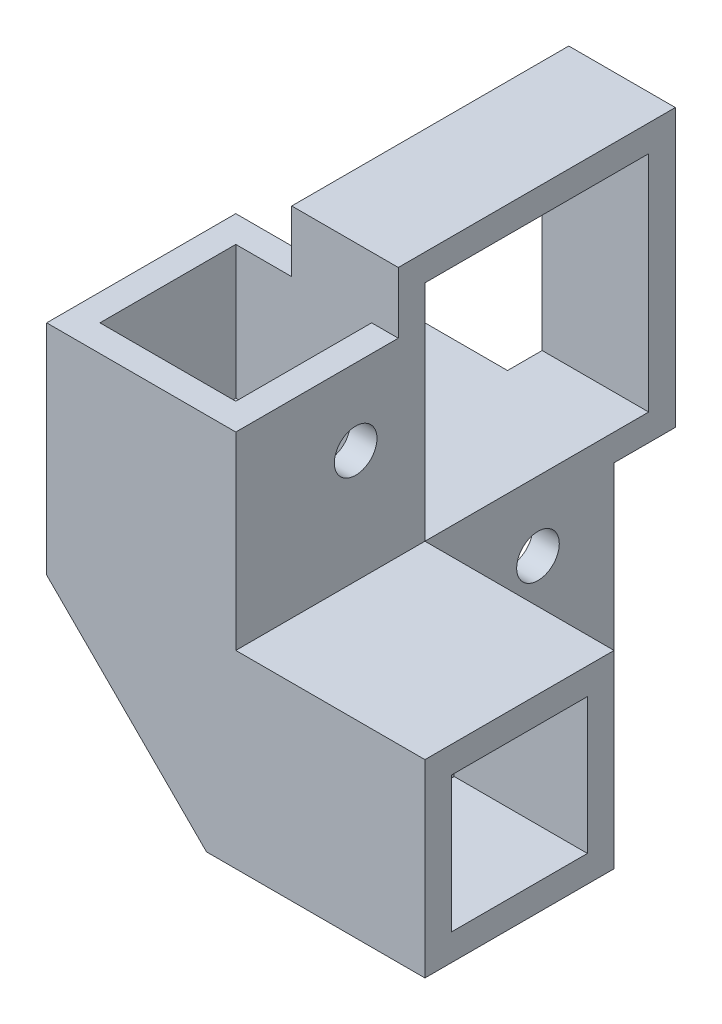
ISO-10303-21;
HEADER;
FILE_DESCRIPTION(('STEP AP214'),'2;1');
FILE_NAME('part.step','',(''),(''),'','','');
FILE_SCHEMA(('AUTOMOTIVE_DESIGN { 1 0 10303 214 1 1 1 1 }'));
ENDSEC;
DATA;
#1=APPLICATION_CONTEXT('core data for automotive mechanical design processes');
#2=APPLICATION_PROTOCOL_DEFINITION('international standard','automotive_design',2000,#1);
#3=PRODUCT_CONTEXT('',#1,'mechanical');
#4=PRODUCT('Part','Part','',(#3));
#5=PRODUCT_RELATED_PRODUCT_CATEGORY('part','',(#4));
#6=PRODUCT_DEFINITION_FORMATION('','',#4);
#7=PRODUCT_DEFINITION_CONTEXT('part definition',#1,'design');
#8=PRODUCT_DEFINITION('design','',#6,#7);
#9=PRODUCT_DEFINITION_SHAPE('','',#8);
#10=(LENGTH_UNIT() NAMED_UNIT(*) SI_UNIT(.MILLI.,.METRE.));
#11=(NAMED_UNIT(*) PLANE_ANGLE_UNIT() SI_UNIT($,.RADIAN.));
#12=(NAMED_UNIT(*) SI_UNIT($,.STERADIAN.) SOLID_ANGLE_UNIT());
#13=UNCERTAINTY_MEASURE_WITH_UNIT(LENGTH_MEASURE(1.E-05),#10,'distance_accuracy_value','');
#14=(GEOMETRIC_REPRESENTATION_CONTEXT(3) GLOBAL_UNCERTAINTY_ASSIGNED_CONTEXT((#13)) GLOBAL_UNIT_ASSIGNED_CONTEXT((#10,
#11,#12)) REPRESENTATION_CONTEXT('',''));
#15=CARTESIAN_POINT('',(0.,0.,0.));
#16=DIRECTION('',(0.,0.,1.));
#17=DIRECTION('',(1.,0.,0.));
#18=AXIS2_PLACEMENT_3D('',#15,#16,#17);
#19=CARTESIAN_POINT('',(0.,0.,0.));
#20=DIRECTION('',(0.,-1.,0.));
#21=DIRECTION('',(0.,0.,-1.));
#22=AXIS2_PLACEMENT_3D('',#19,#20,#21);
#23=PLANE('',#22);
#24=DIRECTION('',(1.,0.,0.));
#25=VECTOR('',#24,1.);
#26=CARTESIAN_POINT('',(53.25,0.,17.75));
#27=LINE('',#26,#25);
#28=CARTESIAN_POINT('',(12.25,0.,17.75));
#29=VERTEX_POINT('',#28);
#30=CARTESIAN_POINT('',(53.25,0.,17.75));
#31=VERTEX_POINT('',#30);
#32=EDGE_CURVE('E460',#29,#31,#27,.T.);
#33=ORIENTED_EDGE('',*,*,#32,.F.);
#34=DIRECTION('',(-0.707106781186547,0.,-0.707106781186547));
#35=VECTOR('',#34,1.);
#36=CARTESIAN_POINT('',(-2.75,0.,2.75));
#37=LINE('',#36,#35);
#38=CARTESIAN_POINT('',(-17.75,0.,-12.25));
#39=VERTEX_POINT('',#38);
#40=EDGE_CURVE('E11',#29,#39,#37,.T.);
#41=ORIENTED_EDGE('',*,*,#40,.T.);
#42=DIRECTION('',(0.,0.,1.));
#43=VECTOR('',#42,1.);
#44=CARTESIAN_POINT('',(-17.75,0.,17.75));
#45=LINE('',#44,#43);
#46=CARTESIAN_POINT('',(-17.75,0.,-53.25));
#47=VERTEX_POINT('',#46);
#48=EDGE_CURVE('E457',#47,#39,#45,.T.);
#49=ORIENTED_EDGE('',*,*,#48,.F.);
#50=DIRECTION('',(-1.,0.,0.));
#51=VECTOR('',#50,1.);
#52=CARTESIAN_POINT('',(-17.75,0.,-53.25));
#53=LINE('',#52,#51);
#54=CARTESIAN_POINT('',(17.75,0.,-53.25));
#55=VERTEX_POINT('',#54);
#56=EDGE_CURVE('E454',#55,#47,#53,.T.);
#57=ORIENTED_EDGE('',*,*,#56,.F.);
#58=DIRECTION('',(0.,0.,-1.));
#59=VECTOR('',#58,1.);
#60=CARTESIAN_POINT('',(17.75,0.,-53.25));
#61=LINE('',#60,#59);
#62=CARTESIAN_POINT('',(17.75,0.,-17.75));
#63=VERTEX_POINT('',#62);
#64=EDGE_CURVE('E451',#63,#55,#61,.T.);
#65=ORIENTED_EDGE('',*,*,#64,.F.);
#66=DIRECTION('',(-1.,0.,0.));
#67=VECTOR('',#66,1.);
#68=CARTESIAN_POINT('',(17.75,0.,-17.75));
#69=LINE('',#68,#67);
#70=CARTESIAN_POINT('',(53.25,0.,-17.75));
#71=VERTEX_POINT('',#70);
#72=EDGE_CURVE('E434',#71,#63,#69,.T.);
#73=ORIENTED_EDGE('',*,*,#72,.F.);
#74=DIRECTION('',(0.,0.,-1.));
#75=VECTOR('',#74,1.);
#76=CARTESIAN_POINT('',(53.25,0.,-17.75));
#77=LINE('',#76,#75);
#78=EDGE_CURVE('E438',#31,#71,#77,.T.);
#79=ORIENTED_EDGE('',*,*,#78,.F.);
#80=EDGE_LOOP('',(#33,#41,#49,#57,#65,#73,#79));
#81=FACE_BOUND('',#80,.T.);
#82=ADVANCED_FACE('F37',(#81),#23,.T.);
#83=CARTESIAN_POINT('',(0.,35.5,0.));
#84=DIRECTION('',(0.,-1.,0.));
#85=DIRECTION('',(0.,0.,-1.));
#86=AXIS2_PLACEMENT_3D('',#83,#84,#85);
#87=PLANE('',#86);
#88=DIRECTION('',(0.,0.,-1.));
#89=VECTOR('',#88,1.);
#90=CARTESIAN_POINT('',(17.75,35.5,17.75));
#91=LINE('',#90,#89);
#92=CARTESIAN_POINT('',(17.75,35.5,17.75));
#93=VERTEX_POINT('',#92);
#94=CARTESIAN_POINT('',(17.75,35.5,-17.75));
#95=VERTEX_POINT('',#94);
#96=EDGE_CURVE('E403',#93,#95,#91,.T.);
#97=ORIENTED_EDGE('',*,*,#96,.F.);
#98=DIRECTION('',(1.,0.,0.));
#99=VECTOR('',#98,1.);
#100=CARTESIAN_POINT('',(-17.75,35.5,17.75));
#101=LINE('',#100,#99);
#102=CARTESIAN_POINT('',(53.25,35.5,17.75));
#103=VERTEX_POINT('',#102);
#104=EDGE_CURVE('E444',#93,#103,#101,.T.);
#105=ORIENTED_EDGE('',*,*,#104,.T.);
#106=DIRECTION('',(0.,0.,-1.));
#107=VECTOR('',#106,1.);
#108=CARTESIAN_POINT('',(53.25,35.5,-17.75));
#109=LINE('',#108,#107);
#110=CARTESIAN_POINT('',(53.25,35.5,-17.75));
#111=VERTEX_POINT('',#110);
#112=EDGE_CURVE('E446',#103,#111,#109,.T.);
#113=ORIENTED_EDGE('',*,*,#112,.T.);
#114=DIRECTION('',(-1.,0.,0.));
#115=VECTOR('',#114,1.);
#116=CARTESIAN_POINT('',(17.75,35.5,-17.75));
#117=LINE('',#116,#115);
#118=EDGE_CURVE('E435',#111,#95,#117,.T.);
#119=ORIENTED_EDGE('',*,*,#118,.T.);
#120=EDGE_LOOP('',(#97,#105,#113,#119));
#121=FACE_BOUND('',#120,.T.);
#122=ADVANCED_FACE('F522',(#121),#87,.F.);
#123=DIRECTION('',(-1.,0.,0.));
#124=VECTOR('',#123,1.);
#125=CARTESIAN_POINT('',(-17.75,35.5,-17.75));
#126=LINE('',#125,#124);
#127=CARTESIAN_POINT('',(-17.75,35.5,-17.75));
#128=VERTEX_POINT('',#127);
#129=EDGE_CURVE('E414',#95,#128,#126,.T.);
#130=ORIENTED_EDGE('',*,*,#129,.F.);
#131=DIRECTION('',(0.,0.,-1.));
#132=VECTOR('',#131,1.);
#133=CARTESIAN_POINT('',(17.75,35.5,-53.25));
#134=LINE('',#133,#132);
#135=CARTESIAN_POINT('',(17.75,35.5,-59.75));
#136=VERTEX_POINT('',#135);
#137=EDGE_CURVE('E238',#95,#136,#134,.T.);
#138=ORIENTED_EDGE('',*,*,#137,.T.);
#139=DIRECTION('',(1.,0.,0.));
#140=VECTOR('',#139,1.);
#141=CARTESIAN_POINT('',(-2.25,35.5,-59.75));
#142=LINE('',#141,#140);
#143=CARTESIAN_POINT('',(-2.25,35.5,-59.75));
#144=VERTEX_POINT('',#143);
#145=EDGE_CURVE('E232',#144,#136,#142,.T.);
#146=ORIENTED_EDGE('',*,*,#145,.F.);
#147=DIRECTION('',(0.,0.,1.));
#148=VECTOR('',#147,1.);
#149=CARTESIAN_POINT('',(-2.25,35.5,-59.75));
#150=LINE('',#149,#148);
#151=CARTESIAN_POINT('',(-2.25,35.5,-53.25));
#152=VERTEX_POINT('',#151);
#153=EDGE_CURVE('E235',#144,#152,#150,.T.);
#154=ORIENTED_EDGE('',*,*,#153,.T.);
#155=DIRECTION('',(-1.,0.,0.));
#156=VECTOR('',#155,1.);
#157=CARTESIAN_POINT('',(-17.75,35.5,-53.25));
#158=LINE('',#157,#156);
#159=CARTESIAN_POINT('',(-17.75,35.5,-53.25));
#160=VERTEX_POINT('',#159);
#161=EDGE_CURVE('E440',#152,#160,#158,.T.);
#162=ORIENTED_EDGE('',*,*,#161,.T.);
#163=DIRECTION('',(0.,0.,1.));
#164=VECTOR('',#163,1.);
#165=CARTESIAN_POINT('',(-17.75,35.5,-17.75));
#166=LINE('',#165,#164);
#167=EDGE_CURVE('E442',#160,#128,#166,.T.);
#168=ORIENTED_EDGE('',*,*,#167,.T.);
#169=EDGE_LOOP('',(#130,#138,#146,#154,#162,#168));
#170=FACE_BOUND('',#169,.T.);
#171=ADVANCED_FACE('F234',(#170),#87,.F.);
#172=CARTESIAN_POINT('',(17.75,35.5,-17.75));
#173=DIRECTION('',(0.,0.,1.));
#174=DIRECTION('',(1.,0.,0.));
#175=AXIS2_PLACEMENT_3D('',#172,#173,#174);
#176=PLANE('',#175);
#177=ORIENTED_EDGE('',*,*,#72,.T.);
#178=DIRECTION('',(0.,-1.,0.));
#179=VECTOR('',#178,1.);
#180=CARTESIAN_POINT('',(17.75,35.5,-17.75));
#181=LINE('',#180,#179);
#182=EDGE_CURVE('E476',#95,#63,#181,.T.);
#183=ORIENTED_EDGE('',*,*,#182,.F.);
#184=ORIENTED_EDGE('',*,*,#118,.F.);
#185=DIRECTION('',(0.,-1.,0.));
#186=VECTOR('',#185,1.);
#187=CARTESIAN_POINT('',(53.25,35.5,-17.75));
#188=LINE('',#187,#186);
#189=EDGE_CURVE('E448',#111,#71,#188,.T.);
#190=ORIENTED_EDGE('',*,*,#189,.T.);
#191=EDGE_LOOP('',(#177,#183,#184,#190));
#192=FACE_BOUND('',#191,.T.);
#193=ADVANCED_FACE('F39',(#192),#176,.F.);
#194=CARTESIAN_POINT('',(17.75,35.5,-53.25));
#195=DIRECTION('',(-1.,0.,0.));
#196=DIRECTION('',(0.,0.,1.));
#197=AXIS2_PLACEMENT_3D('',#194,#195,#196);
#198=PLANE('',#197);
#199=CARTESIAN_POINT('',(17.75,56.72,-4.75));
#200=DIRECTION('',(1.,0.,0.));
#201=DIRECTION('',(0.,0.,-1.));
#202=AXIS2_PLACEMENT_3D('',#199,#200,#201);
#203=CIRCLE('',#202,4.);
#204=CARTESIAN_POINT('',(17.75,56.72,-8.75000000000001));
#205=VERTEX_POINT('',#204);
#206=EDGE_CURVE('E482',#205,#205,#203,.T.);
#207=ORIENTED_EDGE('',*,*,#206,.F.);
#208=EDGE_LOOP('',(#207));
#209=FACE_BOUND('',#208,.T.);
#210=CARTESIAN_POINT('',(17.75,22.5,-38.97));
#211=DIRECTION('',(1.,0.,0.));
#212=DIRECTION('',(0.,0.,-1.));
#213=AXIS2_PLACEMENT_3D('',#210,#211,#212);
#214=CIRCLE('',#213,4.);
#215=CARTESIAN_POINT('',(17.75,22.5,-42.97));
#216=VERTEX_POINT('',#215);
#217=EDGE_CURVE('E263',#216,#216,#214,.T.);
#218=ORIENTED_EDGE('',*,*,#217,.F.);
#219=EDGE_LOOP('',(#218));
#220=FACE_BOUND('',#219,.T.);
#221=ORIENTED_EDGE('',*,*,#64,.T.);
#222=DIRECTION('',(0.,-1.,0.));
#223=VECTOR('',#222,1.);
#224=CARTESIAN_POINT('',(17.75,35.5,-53.25));
#225=LINE('',#224,#223);
#226=CARTESIAN_POINT('',(17.75,30.5,-53.25));
#227=VERTEX_POINT('',#226);
#228=EDGE_CURVE('E474',#227,#55,#225,.T.);
#229=ORIENTED_EDGE('',*,*,#228,.F.);
#230=DIRECTION('',(0.,0.,-1.));
#231=VECTOR('',#230,1.);
#232=CARTESIAN_POINT('',(17.75,30.5,-64.75));
#233=LINE('',#232,#231);
#234=CARTESIAN_POINT('',(17.75,30.5,-64.75));
#235=VERTEX_POINT('',#234);
#236=EDGE_CURVE('E286',#227,#235,#233,.T.);
#237=ORIENTED_EDGE('',*,*,#236,.T.);
#238=DIRECTION('',(0.,1.,0.));
#239=VECTOR('',#238,1.);
#240=CARTESIAN_POINT('',(17.75,30.5,-64.75));
#241=LINE('',#240,#239);
#242=CARTESIAN_POINT('',(17.75,82.5,-64.75));
#243=VERTEX_POINT('',#242);
#244=EDGE_CURVE('E289',#235,#243,#241,.T.);
#245=ORIENTED_EDGE('',*,*,#244,.T.);
#246=DIRECTION('',(0.,0.,1.));
#247=VECTOR('',#246,1.);
#248=CARTESIAN_POINT('',(17.75,82.5,-12.75));
#249=LINE('',#248,#247);
#250=CARTESIAN_POINT('',(17.75,82.5,-12.75));
#251=VERTEX_POINT('',#250);
#252=EDGE_CURVE('E292',#243,#251,#249,.T.);
#253=ORIENTED_EDGE('',*,*,#252,.T.);
#254=DIRECTION('',(0.,-1.,0.));
#255=VECTOR('',#254,1.);
#256=CARTESIAN_POINT('',(17.75,71.,-12.75));
#257=LINE('',#256,#255);
#258=CARTESIAN_POINT('',(17.75,71.,-12.75));
#259=VERTEX_POINT('',#258);
#260=EDGE_CURVE('E260',#251,#259,#257,.T.);
#261=ORIENTED_EDGE('',*,*,#260,.T.);
#262=DIRECTION('',(0.,0.,-1.));
#263=VECTOR('',#262,1.);
#264=CARTESIAN_POINT('',(17.75,71.,17.75));
#265=LINE('',#264,#263);
#266=CARTESIAN_POINT('',(17.75,71.,17.75));
#267=VERTEX_POINT('',#266);
#268=EDGE_CURVE('E410',#267,#259,#265,.T.);
#269=ORIENTED_EDGE('',*,*,#268,.F.);
#270=DIRECTION('',(0.,-1.,0.));
#271=VECTOR('',#270,1.);
#272=CARTESIAN_POINT('',(17.75,71.,17.75));
#273=LINE('',#272,#271);
#274=EDGE_CURVE('E421',#267,#93,#273,.T.);
#275=ORIENTED_EDGE('',*,*,#274,.T.);
#276=ORIENTED_EDGE('',*,*,#96,.T.);
#277=DIRECTION('',(0.,-1.,0.));
#278=VECTOR('',#277,1.);
#279=CARTESIAN_POINT('',(17.75,71.,-17.75));
#280=LINE('',#279,#278);
#281=CARTESIAN_POINT('',(17.75,77.5,-17.75));
#282=VERTEX_POINT('',#281);
#283=EDGE_CURVE('E431',#282,#95,#280,.T.);
#284=ORIENTED_EDGE('',*,*,#283,.F.);
#285=DIRECTION('',(0.,0.,-1.));
#286=VECTOR('',#285,1.);
#287=CARTESIAN_POINT('',(17.75,77.5,-17.75));
#288=LINE('',#287,#286);
#289=CARTESIAN_POINT('',(17.75,77.5,-59.75));
#290=VERTEX_POINT('',#289);
#291=EDGE_CURVE('E257',#282,#290,#288,.T.);
#292=ORIENTED_EDGE('',*,*,#291,.T.);
#293=DIRECTION('',(0.,-1.,0.));
#294=VECTOR('',#293,1.);
#295=CARTESIAN_POINT('',(17.75,77.5,-59.75));
#296=LINE('',#295,#294);
#297=EDGE_CURVE('E284',#290,#136,#296,.T.);
#298=ORIENTED_EDGE('',*,*,#297,.T.);
#299=ORIENTED_EDGE('',*,*,#137,.F.);
#300=ORIENTED_EDGE('',*,*,#182,.T.);
#301=EDGE_LOOP('',(#221,#229,#237,#245,#253,#261,#269,#275,#276,#284,#292,#298,#299,#300));
#302=FACE_BOUND('',#301,.T.);
#303=ADVANCED_FACE('F495',(#209,#220,#302),#198,.F.);
#304=CARTESIAN_POINT('',(-17.75,35.5,-53.25));
#305=DIRECTION('',(0.,0.,1.));
#306=DIRECTION('',(1.,0.,0.));
#307=AXIS2_PLACEMENT_3D('',#304,#305,#306);
#308=PLANE('',#307);
#309=DIRECTION('',(0.,-1.,0.));
#310=VECTOR('',#309,1.);
#311=CARTESIAN_POINT('',(12.75,30.5,-53.25));
#312=LINE('',#311,#310);
#313=CARTESIAN_POINT('',(12.75,30.5,-53.25));
#314=VERTEX_POINT('',#313);
#315=CARTESIAN_POINT('',(12.75,5.,-53.25));
#316=VERTEX_POINT('',#315);
#317=EDGE_CURVE('E298',#314,#316,#312,.T.);
#318=ORIENTED_EDGE('',*,*,#317,.F.);
#319=DIRECTION('',(1.,0.,0.));
#320=VECTOR('',#319,1.);
#321=CARTESIAN_POINT('',(-2.25,30.5,-53.25));
#322=LINE('',#321,#320);
#323=EDGE_CURVE('E243',#314,#227,#322,.T.);
#324=ORIENTED_EDGE('',*,*,#323,.T.);
#325=ORIENTED_EDGE('',*,*,#228,.T.);
#326=ORIENTED_EDGE('',*,*,#56,.T.);
#327=DIRECTION('',(0.,-1.,0.));
#328=VECTOR('',#327,1.);
#329=CARTESIAN_POINT('',(-17.75,35.5,-53.25));
#330=LINE('',#329,#328);
#331=EDGE_CURVE('E471',#160,#47,#330,.T.);
#332=ORIENTED_EDGE('',*,*,#331,.F.);
#333=ORIENTED_EDGE('',*,*,#161,.F.);
#334=DIRECTION('',(0.,-1.,0.));
#335=VECTOR('',#334,1.);
#336=CARTESIAN_POINT('',(-2.25,35.5,-53.25));
#337=LINE('',#336,#335);
#338=CARTESIAN_POINT('',(-2.25,30.5,-53.25));
#339=VERTEX_POINT('',#338);
#340=EDGE_CURVE('E253',#152,#339,#337,.T.);
#341=ORIENTED_EDGE('',*,*,#340,.T.);
#342=DIRECTION('',(1.,0.,0.));
#343=VECTOR('',#342,1.);
#344=CARTESIAN_POINT('',(-12.75,30.5,-53.25));
#345=LINE('',#344,#343);
#346=CARTESIAN_POINT('',(-12.75,30.5,-53.25));
#347=VERTEX_POINT('',#346);
#348=EDGE_CURVE('E316',#347,#339,#345,.T.);
#349=ORIENTED_EDGE('',*,*,#348,.F.);
#350=DIRECTION('',(0.,1.,0.));
#351=VECTOR('',#350,1.);
#352=CARTESIAN_POINT('',(-12.75,5.,-53.25));
#353=LINE('',#352,#351);
#354=CARTESIAN_POINT('',(-12.75,5.,-53.25));
#355=VERTEX_POINT('',#354);
#356=EDGE_CURVE('E330',#355,#347,#353,.T.);
#357=ORIENTED_EDGE('',*,*,#356,.F.);
#358=DIRECTION('',(-1.,0.,0.));
#359=VECTOR('',#358,1.);
#360=CARTESIAN_POINT('',(12.75,5.,-53.25));
#361=LINE('',#360,#359);
#362=EDGE_CURVE('E327',#316,#355,#361,.T.);
#363=ORIENTED_EDGE('',*,*,#362,.F.);
#364=EDGE_LOOP('',(#318,#324,#325,#326,#332,#333,#341,#349,#357,#363));
#365=FACE_BOUND('',#364,.T.);
#366=ADVANCED_FACE('F498',(#365),#308,.F.);
#367=CARTESIAN_POINT('',(-17.75,35.5,17.75));
#368=DIRECTION('',(1.,0.,0.));
#369=DIRECTION('',(0.,0.,-1.));
#370=AXIS2_PLACEMENT_3D('',#367,#368,#369);
#371=PLANE('',#370);
#372=DIRECTION('',(0.,-0.707106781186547,-0.707106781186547));
#373=VECTOR('',#372,1.);
#374=CARTESIAN_POINT('',(-17.75,32.75,20.5));
#375=LINE('',#374,#373);
#376=CARTESIAN_POINT('',(-17.75,30.,17.75));
#377=VERTEX_POINT('',#376);
#378=EDGE_CURVE('E62',#377,#39,#375,.T.);
#379=ORIENTED_EDGE('',*,*,#378,.F.);
#380=DIRECTION('',(0.,-1.,0.));
#381=VECTOR('',#380,1.);
#382=CARTESIAN_POINT('',(-17.75,35.5,17.75));
#383=LINE('',#382,#381);
#384=CARTESIAN_POINT('',(-17.75,71.,17.75));
#385=VERTEX_POINT('',#384);
#386=EDGE_CURVE('E468',#385,#377,#383,.T.);
#387=ORIENTED_EDGE('',*,*,#386,.F.);
#388=DIRECTION('',(0.,0.,1.));
#389=VECTOR('',#388,1.);
#390=CARTESIAN_POINT('',(-17.75,71.,17.75));
#391=LINE('',#390,#389);
#392=CARTESIAN_POINT('',(-17.75,71.,-17.75));
#393=VERTEX_POINT('',#392);
#394=EDGE_CURVE('E416',#393,#385,#391,.T.);
#395=ORIENTED_EDGE('',*,*,#394,.F.);
#396=DIRECTION('',(0.,-1.,0.));
#397=VECTOR('',#396,1.);
#398=CARTESIAN_POINT('',(-17.75,71.,-17.75));
#399=LINE('',#398,#397);
#400=EDGE_CURVE('E428',#393,#128,#399,.T.);
#401=ORIENTED_EDGE('',*,*,#400,.T.);
#402=ORIENTED_EDGE('',*,*,#167,.F.);
#403=ORIENTED_EDGE('',*,*,#331,.T.);
#404=ORIENTED_EDGE('',*,*,#48,.T.);
#405=EDGE_LOOP('',(#379,#387,#395,#401,#402,#403,#404));
#406=FACE_BOUND('',#405,.T.);
#407=ADVANCED_FACE('F511',(#406),#371,.F.);
#408=CARTESIAN_POINT('',(53.25,35.5,17.75));
#409=DIRECTION('',(0.,0.,-1.));
#410=DIRECTION('',(-1.,0.,0.));
#411=AXIS2_PLACEMENT_3D('',#408,#409,#410);
#412=PLANE('',#411);
#413=DIRECTION('',(-0.707106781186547,0.707106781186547,0.));
#414=VECTOR('',#413,1.);
#415=CARTESIAN_POINT('',(15.,-2.75,17.75));
#416=LINE('',#415,#414);
#417=EDGE_CURVE('E46',#29,#377,#416,.T.);
#418=ORIENTED_EDGE('',*,*,#417,.F.);
#419=ORIENTED_EDGE('',*,*,#32,.T.);
#420=DIRECTION('',(0.,-1.,0.));
#421=VECTOR('',#420,1.);
#422=CARTESIAN_POINT('',(53.25,35.5,17.75));
#423=LINE('',#422,#421);
#424=EDGE_CURVE('E465',#103,#31,#423,.T.);
#425=ORIENTED_EDGE('',*,*,#424,.F.);
#426=ORIENTED_EDGE('',*,*,#104,.F.);
#427=ORIENTED_EDGE('',*,*,#274,.F.);
#428=DIRECTION('',(1.,0.,0.));
#429=VECTOR('',#428,1.);
#430=CARTESIAN_POINT('',(-17.75,71.,17.75));
#431=LINE('',#430,#429);
#432=EDGE_CURVE('E419',#385,#267,#431,.T.);
#433=ORIENTED_EDGE('',*,*,#432,.F.);
#434=ORIENTED_EDGE('',*,*,#386,.T.);
#435=EDGE_LOOP('',(#418,#419,#425,#426,#427,#433,#434));
#436=FACE_BOUND('',#435,.T.);
#437=ADVANCED_FACE('F527',(#436),#412,.F.);
#438=CARTESIAN_POINT('',(53.25,35.5,-17.75));
#439=DIRECTION('',(-1.,0.,0.));
#440=DIRECTION('',(0.,0.,1.));
#441=AXIS2_PLACEMENT_3D('',#438,#439,#440);
#442=PLANE('',#441);
#443=DIRECTION('',(0.,0.,-1.));
#444=VECTOR('',#443,1.);
#445=CARTESIAN_POINT('',(53.25,5.,12.75));
#446=LINE('',#445,#444);
#447=CARTESIAN_POINT('',(53.25,5.,12.75));
#448=VERTEX_POINT('',#447);
#449=CARTESIAN_POINT('',(53.25,5.,-12.75));
#450=VERTEX_POINT('',#449);
#451=EDGE_CURVE('E393',#448,#450,#446,.T.);
#452=ORIENTED_EDGE('',*,*,#451,.F.);
#453=DIRECTION('',(0.,-1.,0.));
#454=VECTOR('',#453,1.);
#455=CARTESIAN_POINT('',(53.25,30.5,12.75));
#456=LINE('',#455,#454);
#457=CARTESIAN_POINT('',(53.25,30.5,12.75));
#458=VERTEX_POINT('',#457);
#459=EDGE_CURVE('E369',#458,#448,#456,.T.);
#460=ORIENTED_EDGE('',*,*,#459,.F.);
#461=DIRECTION('',(0.,0.,1.));
#462=VECTOR('',#461,1.);
#463=CARTESIAN_POINT('',(53.25,30.5,-12.75));
#464=LINE('',#463,#462);
#465=CARTESIAN_POINT('',(53.25,30.5,-12.75));
#466=VERTEX_POINT('',#465);
#467=EDGE_CURVE('E382',#466,#458,#464,.T.);
#468=ORIENTED_EDGE('',*,*,#467,.F.);
#469=DIRECTION('',(0.,1.,0.));
#470=VECTOR('',#469,1.);
#471=CARTESIAN_POINT('',(53.25,5.,-12.75));
#472=LINE('',#471,#470);
#473=EDGE_CURVE('E396',#450,#466,#472,.T.);
#474=ORIENTED_EDGE('',*,*,#473,.F.);
#475=EDGE_LOOP('',(#452,#460,#468,#474));
#476=FACE_BOUND('',#475,.T.);
#477=ORIENTED_EDGE('',*,*,#78,.T.);
#478=ORIENTED_EDGE('',*,*,#189,.F.);
#479=ORIENTED_EDGE('',*,*,#112,.F.);
#480=ORIENTED_EDGE('',*,*,#424,.T.);
#481=EDGE_LOOP('',(#477,#478,#479,#480));
#482=FACE_BOUND('',#481,.T.);
#483=ADVANCED_FACE('F533',(#476,#482),#442,.F.);
#484=CARTESIAN_POINT('',(-17.75,71.,-17.75));
#485=DIRECTION('',(0.,0.,1.));
#486=DIRECTION('',(1.,0.,0.));
#487=AXIS2_PLACEMENT_3D('',#484,#485,#486);
#488=PLANE('',#487);
#489=ORIENTED_EDGE('',*,*,#129,.T.);
#490=ORIENTED_EDGE('',*,*,#400,.F.);
#491=DIRECTION('',(-1.,0.,0.));
#492=VECTOR('',#491,1.);
#493=CARTESIAN_POINT('',(-17.75,71.,-17.75));
#494=LINE('',#493,#492);
#495=CARTESIAN_POINT('',(-2.25,71.,-17.75));
#496=VERTEX_POINT('',#495);
#497=EDGE_CURVE('E413',#496,#393,#494,.T.);
#498=ORIENTED_EDGE('',*,*,#497,.F.);
#499=DIRECTION('',(0.,1.,0.));
#500=VECTOR('',#499,1.);
#501=CARTESIAN_POINT('',(-2.25,71.,-17.75));
#502=LINE('',#501,#500);
#503=CARTESIAN_POINT('',(-2.25,77.5,-17.75));
#504=VERTEX_POINT('',#503);
#505=EDGE_CURVE('E280',#496,#504,#502,.T.);
#506=ORIENTED_EDGE('',*,*,#505,.T.);
#507=DIRECTION('',(1.,0.,0.));
#508=VECTOR('',#507,1.);
#509=CARTESIAN_POINT('',(-2.25,77.5,-17.75));
#510=LINE('',#509,#508);
#511=EDGE_CURVE('E299',#504,#282,#510,.T.);
#512=ORIENTED_EDGE('',*,*,#511,.T.);
#513=ORIENTED_EDGE('',*,*,#283,.T.);
#514=EDGE_LOOP('',(#489,#490,#498,#506,#512,#513));
#515=FACE_BOUND('',#514,.T.);
#516=ADVANCED_FACE('F515',(#515),#488,.F.);
#517=CARTESIAN_POINT('',(0.,71.,0.));
#518=DIRECTION('',(0.,-1.,0.));
#519=DIRECTION('',(0.,0.,-1.));
#520=AXIS2_PLACEMENT_3D('',#517,#518,#519);
#521=PLANE('',#520);
#522=ORIENTED_EDGE('',*,*,#268,.T.);
#523=DIRECTION('',(1.,0.,0.));
#524=VECTOR('',#523,1.);
#525=CARTESIAN_POINT('',(-2.25,71.,-12.75));
#526=LINE('',#525,#524);
#527=CARTESIAN_POINT('',(12.75,71.,-12.75));
#528=VERTEX_POINT('',#527);
#529=EDGE_CURVE('E302',#528,#259,#526,.T.);
#530=ORIENTED_EDGE('',*,*,#529,.F.);
#531=DIRECTION('',(0.,0.,-1.));
#532=VECTOR('',#531,1.);
#533=CARTESIAN_POINT('',(12.75,71.,12.75));
#534=LINE('',#533,#532);
#535=CARTESIAN_POINT('',(12.75,71.,12.75));
#536=VERTEX_POINT('',#535);
#537=EDGE_CURVE('E360',#536,#528,#534,.T.);
#538=ORIENTED_EDGE('',*,*,#537,.F.);
#539=DIRECTION('',(1.,0.,0.));
#540=VECTOR('',#539,1.);
#541=CARTESIAN_POINT('',(-12.75,71.,12.75));
#542=LINE('',#541,#540);
#543=CARTESIAN_POINT('',(-12.75,71.,12.75));
#544=VERTEX_POINT('',#543);
#545=EDGE_CURVE('E338',#544,#536,#542,.T.);
#546=ORIENTED_EDGE('',*,*,#545,.F.);
#547=DIRECTION('',(0.,0.,1.));
#548=VECTOR('',#547,1.);
#549=CARTESIAN_POINT('',(-12.75,71.,-12.75));
#550=LINE('',#549,#548);
#551=CARTESIAN_POINT('',(-12.75,71.,-12.75));
#552=VERTEX_POINT('',#551);
#553=EDGE_CURVE('E349',#552,#544,#550,.T.);
#554=ORIENTED_EDGE('',*,*,#553,.F.);
#555=DIRECTION('',(-1.,0.,0.));
#556=VECTOR('',#555,1.);
#557=CARTESIAN_POINT('',(12.75,71.,-12.75));
#558=LINE('',#557,#556);
#559=CARTESIAN_POINT('',(-2.25,71.,-12.75));
#560=VERTEX_POINT('',#559);
#561=EDGE_CURVE('E363',#560,#552,#558,.T.);
#562=ORIENTED_EDGE('',*,*,#561,.F.);
#563=DIRECTION('',(0.,0.,-1.));
#564=VECTOR('',#563,1.);
#565=CARTESIAN_POINT('',(-2.25,71.,-12.75));
#566=LINE('',#565,#564);
#567=EDGE_CURVE('E277',#560,#496,#566,.T.);
#568=ORIENTED_EDGE('',*,*,#567,.T.);
#569=ORIENTED_EDGE('',*,*,#497,.T.);
#570=ORIENTED_EDGE('',*,*,#394,.T.);
#571=ORIENTED_EDGE('',*,*,#432,.T.);
#572=EDGE_LOOP('',(#522,#530,#538,#546,#554,#562,#568,#569,#570,#571));
#573=FACE_BOUND('',#572,.T.);
#574=ADVANCED_FACE('F537',(#573),#521,.F.);
#575=CARTESIAN_POINT('',(28.25,30.5,12.75));
#576=DIRECTION('',(0.,0.,1.));
#577=DIRECTION('',(1.,0.,0.));
#578=AXIS2_PLACEMENT_3D('',#575,#576,#577);
#579=PLANE('',#578);
#580=ORIENTED_EDGE('',*,*,#459,.T.);
#581=DIRECTION('',(1.,0.,0.));
#582=VECTOR('',#581,1.);
#583=CARTESIAN_POINT('',(28.25,5.,12.75));
#584=LINE('',#583,#582);
#585=CARTESIAN_POINT('',(28.25,5.,12.75));
#586=VERTEX_POINT('',#585);
#587=EDGE_CURVE('E391',#586,#448,#584,.T.);
#588=ORIENTED_EDGE('',*,*,#587,.F.);
#589=DIRECTION('',(0.,-1.,0.));
#590=VECTOR('',#589,1.);
#591=CARTESIAN_POINT('',(28.25,30.5,12.75));
#592=LINE('',#591,#590);
#593=CARTESIAN_POINT('',(28.25,30.5,12.75));
#594=VERTEX_POINT('',#593);
#595=EDGE_CURVE('E378',#594,#586,#592,.T.);
#596=ORIENTED_EDGE('',*,*,#595,.F.);
#597=DIRECTION('',(1.,0.,0.));
#598=VECTOR('',#597,1.);
#599=CARTESIAN_POINT('',(28.25,30.5,12.75));
#600=LINE('',#599,#598);
#601=EDGE_CURVE('E401',#594,#458,#600,.T.);
#602=ORIENTED_EDGE('',*,*,#601,.T.);
#603=EDGE_LOOP('',(#580,#588,#596,#602));
#604=FACE_BOUND('',#603,.T.);
#605=ADVANCED_FACE('F601',(#604),#579,.F.);
#606=CARTESIAN_POINT('',(28.25,30.5,-12.75));
#607=DIRECTION('',(0.,1.,0.));
#608=DIRECTION('',(0.,0.,1.));
#609=AXIS2_PLACEMENT_3D('',#606,#607,#608);
#610=PLANE('',#609);
#611=ORIENTED_EDGE('',*,*,#467,.T.);
#612=ORIENTED_EDGE('',*,*,#601,.F.);
#613=DIRECTION('',(0.,0.,1.));
#614=VECTOR('',#613,1.);
#615=CARTESIAN_POINT('',(28.25,30.5,-12.75));
#616=LINE('',#615,#614);
#617=CARTESIAN_POINT('',(28.25,30.5,-12.75));
#618=VERTEX_POINT('',#617);
#619=EDGE_CURVE('E388',#618,#594,#616,.T.);
#620=ORIENTED_EDGE('',*,*,#619,.F.);
#621=DIRECTION('',(1.,0.,0.));
#622=VECTOR('',#621,1.);
#623=CARTESIAN_POINT('',(28.25,30.5,-12.75));
#624=LINE('',#623,#622);
#625=EDGE_CURVE('E404',#618,#466,#624,.T.);
#626=ORIENTED_EDGE('',*,*,#625,.T.);
#627=EDGE_LOOP('',(#611,#612,#620,#626));
#628=FACE_BOUND('',#627,.T.);
#629=ADVANCED_FACE('F608',(#628),#610,.F.);
#630=CARTESIAN_POINT('',(28.25,5.,-12.75));
#631=DIRECTION('',(0.,0.,-1.));
#632=DIRECTION('',(-1.,0.,0.));
#633=AXIS2_PLACEMENT_3D('',#630,#631,#632);
#634=PLANE('',#633);
#635=ORIENTED_EDGE('',*,*,#473,.T.);
#636=ORIENTED_EDGE('',*,*,#625,.F.);
#637=DIRECTION('',(0.,1.,0.));
#638=VECTOR('',#637,1.);
#639=CARTESIAN_POINT('',(28.25,5.,-12.75));
#640=LINE('',#639,#638);
#641=CARTESIAN_POINT('',(28.25,5.,-12.75));
#642=VERTEX_POINT('',#641);
#643=EDGE_CURVE('E385',#642,#618,#640,.T.);
#644=ORIENTED_EDGE('',*,*,#643,.F.);
#645=DIRECTION('',(1.,0.,0.));
#646=VECTOR('',#645,1.);
#647=CARTESIAN_POINT('',(28.25,5.,-12.75));
#648=LINE('',#647,#646);
#649=EDGE_CURVE('E406',#642,#450,#648,.T.);
#650=ORIENTED_EDGE('',*,*,#649,.T.);
#651=EDGE_LOOP('',(#635,#636,#644,#650));
#652=FACE_BOUND('',#651,.T.);
#653=ADVANCED_FACE('F616',(#652),#634,.F.);
#654=CARTESIAN_POINT('',(28.25,5.,12.75));
#655=DIRECTION('',(0.,-1.,0.));
#656=DIRECTION('',(0.,0.,-1.));
#657=AXIS2_PLACEMENT_3D('',#654,#655,#656);
#658=PLANE('',#657);
#659=ORIENTED_EDGE('',*,*,#451,.T.);
#660=ORIENTED_EDGE('',*,*,#649,.F.);
#661=DIRECTION('',(0.,0.,-1.));
#662=VECTOR('',#661,1.);
#663=CARTESIAN_POINT('',(28.25,5.,12.75));
#664=LINE('',#663,#662);
#665=EDGE_CURVE('E381',#586,#642,#664,.T.);
#666=ORIENTED_EDGE('',*,*,#665,.F.);
#667=ORIENTED_EDGE('',*,*,#587,.T.);
#668=EDGE_LOOP('',(#659,#660,#666,#667));
#669=FACE_BOUND('',#668,.T.);
#670=ADVANCED_FACE('F624',(#669),#658,.F.);
#671=CARTESIAN_POINT('',(28.25,0.,0.));
#672=DIRECTION('',(1.,0.,0.));
#673=DIRECTION('',(0.,0.,-1.));
#674=AXIS2_PLACEMENT_3D('',#671,#672,#673);
#675=PLANE('',#674);
#676=ORIENTED_EDGE('',*,*,#595,.T.);
#677=ORIENTED_EDGE('',*,*,#665,.T.);
#678=ORIENTED_EDGE('',*,*,#643,.T.);
#679=ORIENTED_EDGE('',*,*,#619,.T.);
#680=EDGE_LOOP('',(#676,#677,#678,#679));
#681=FACE_BOUND('',#680,.T.);
#682=ADVANCED_FACE('F632',(#681),#675,.T.);
#683=CARTESIAN_POINT('',(-12.75,46.,12.75));
#684=DIRECTION('',(0.,0.,1.));
#685=DIRECTION('',(1.,0.,0.));
#686=AXIS2_PLACEMENT_3D('',#683,#684,#685);
#687=PLANE('',#686);
#688=ORIENTED_EDGE('',*,*,#545,.T.);
#689=DIRECTION('',(0.,1.,0.));
#690=VECTOR('',#689,1.);
#691=CARTESIAN_POINT('',(12.75,46.,12.75));
#692=LINE('',#691,#690);
#693=CARTESIAN_POINT('',(12.75,46.,12.75));
#694=VERTEX_POINT('',#693);
#695=EDGE_CURVE('E358',#694,#536,#692,.T.);
#696=ORIENTED_EDGE('',*,*,#695,.F.);
#697=DIRECTION('',(1.,0.,0.));
#698=VECTOR('',#697,1.);
#699=CARTESIAN_POINT('',(-12.75,46.,12.75));
#700=LINE('',#699,#698);
#701=CARTESIAN_POINT('',(-12.75,46.,12.75));
#702=VERTEX_POINT('',#701);
#703=EDGE_CURVE('E345',#702,#694,#700,.T.);
#704=ORIENTED_EDGE('',*,*,#703,.F.);
#705=DIRECTION('',(0.,1.,0.));
#706=VECTOR('',#705,1.);
#707=CARTESIAN_POINT('',(-12.75,46.,12.75));
#708=LINE('',#707,#706);
#709=EDGE_CURVE('E367',#702,#544,#708,.T.);
#710=ORIENTED_EDGE('',*,*,#709,.T.);
#711=EDGE_LOOP('',(#688,#696,#704,#710));
#712=FACE_BOUND('',#711,.T.);
#713=ADVANCED_FACE('F640',(#712),#687,.F.);
#714=CARTESIAN_POINT('',(-12.75,46.,-12.75));
#715=DIRECTION('',(-1.,0.,0.));
#716=DIRECTION('',(0.,0.,1.));
#717=AXIS2_PLACEMENT_3D('',#714,#715,#716);
#718=PLANE('',#717);
#719=ORIENTED_EDGE('',*,*,#553,.T.);
#720=ORIENTED_EDGE('',*,*,#709,.F.);
#721=DIRECTION('',(0.,0.,1.));
#722=VECTOR('',#721,1.);
#723=CARTESIAN_POINT('',(-12.75,46.,-12.75));
#724=LINE('',#723,#722);
#725=CARTESIAN_POINT('',(-12.75,46.,-12.75));
#726=VERTEX_POINT('',#725);
#727=EDGE_CURVE('E355',#726,#702,#724,.T.);
#728=ORIENTED_EDGE('',*,*,#727,.F.);
#729=DIRECTION('',(0.,1.,0.));
#730=VECTOR('',#729,1.);
#731=CARTESIAN_POINT('',(-12.75,46.,-12.75));
#732=LINE('',#731,#730);
#733=EDGE_CURVE('E370',#726,#552,#732,.T.);
#734=ORIENTED_EDGE('',*,*,#733,.T.);
#735=EDGE_LOOP('',(#719,#720,#728,#734));
#736=FACE_BOUND('',#735,.T.);
#737=ADVANCED_FACE('F648',(#736),#718,.F.);
#738=CARTESIAN_POINT('',(12.75,46.,-12.75));
#739=DIRECTION('',(0.,0.,-1.));
#740=DIRECTION('',(-1.,0.,0.));
#741=AXIS2_PLACEMENT_3D('',#738,#739,#740);
#742=PLANE('',#741);
#743=DIRECTION('',(0.,1.,0.));
#744=VECTOR('',#743,1.);
#745=CARTESIAN_POINT('',(12.75,46.,-12.75));
#746=LINE('',#745,#744);
#747=CARTESIAN_POINT('',(12.75,46.,-12.75));
#748=VERTEX_POINT('',#747);
#749=EDGE_CURVE('E373',#748,#528,#746,.T.);
#750=ORIENTED_EDGE('',*,*,#749,.T.);
#751=ORIENTED_EDGE('',*,*,#529,.T.);
#752=ORIENTED_EDGE('',*,*,#260,.F.);
#753=DIRECTION('',(1.,0.,0.));
#754=VECTOR('',#753,1.);
#755=CARTESIAN_POINT('',(-2.25,82.5,-12.75));
#756=LINE('',#755,#754);
#757=CARTESIAN_POINT('',(-2.25,82.5,-12.75));
#758=VERTEX_POINT('',#757);
#759=EDGE_CURVE('E304',#758,#251,#756,.T.);
#760=ORIENTED_EDGE('',*,*,#759,.F.);
#761=DIRECTION('',(0.,-1.,0.));
#762=VECTOR('',#761,1.);
#763=CARTESIAN_POINT('',(-2.25,71.,-12.75));
#764=LINE('',#763,#762);
#765=EDGE_CURVE('E54',#758,#560,#764,.T.);
#766=ORIENTED_EDGE('',*,*,#765,.T.);
#767=ORIENTED_EDGE('',*,*,#561,.T.);
#768=ORIENTED_EDGE('',*,*,#733,.F.);
#769=DIRECTION('',(-1.,0.,0.));
#770=VECTOR('',#769,1.);
#771=CARTESIAN_POINT('',(12.75,46.,-12.75));
#772=LINE('',#771,#770);
#773=EDGE_CURVE('E352',#748,#726,#772,.T.);
#774=ORIENTED_EDGE('',*,*,#773,.F.);
#775=EDGE_LOOP('',(#750,#751,#752,#760,#766,#767,#768,#774));
#776=FACE_BOUND('',#775,.T.);
#777=ADVANCED_FACE('F656',(#776),#742,.F.);
#778=CARTESIAN_POINT('',(12.75,46.,12.75));
#779=DIRECTION('',(1.,0.,0.));
#780=DIRECTION('',(0.,0.,-1.));
#781=AXIS2_PLACEMENT_3D('',#778,#779,#780);
#782=PLANE('',#781);
#783=CARTESIAN_POINT('',(12.75,56.72,-4.75000000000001));
#784=DIRECTION('',(1.,0.,0.));
#785=DIRECTION('',(0.,0.,-1.));
#786=AXIS2_PLACEMENT_3D('',#783,#784,#785);
#787=CIRCLE('',#786,4.);
#788=CARTESIAN_POINT('',(12.75,56.72,-8.75000000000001));
#789=VERTEX_POINT('',#788);
#790=EDGE_CURVE('E41',#789,#789,#787,.T.);
#791=ORIENTED_EDGE('',*,*,#790,.T.);
#792=EDGE_LOOP('',(#791));
#793=FACE_BOUND('',#792,.T.);
#794=ORIENTED_EDGE('',*,*,#537,.T.);
#795=ORIENTED_EDGE('',*,*,#749,.F.);
#796=DIRECTION('',(0.,0.,-1.));
#797=VECTOR('',#796,1.);
#798=CARTESIAN_POINT('',(12.75,46.,12.75));
#799=LINE('',#798,#797);
#800=EDGE_CURVE('E348',#694,#748,#799,.T.);
#801=ORIENTED_EDGE('',*,*,#800,.F.);
#802=ORIENTED_EDGE('',*,*,#695,.T.);
#803=EDGE_LOOP('',(#794,#795,#801,#802));
#804=FACE_BOUND('',#803,.T.);
#805=ADVANCED_FACE('F664',(#793,#804),#782,.F.);
#806=CARTESIAN_POINT('',(0.,46.,0.));
#807=DIRECTION('',(0.,1.,0.));
#808=DIRECTION('',(0.,0.,1.));
#809=AXIS2_PLACEMENT_3D('',#806,#807,#808);
#810=PLANE('',#809);
#811=ORIENTED_EDGE('',*,*,#703,.T.);
#812=ORIENTED_EDGE('',*,*,#800,.T.);
#813=ORIENTED_EDGE('',*,*,#773,.T.);
#814=ORIENTED_EDGE('',*,*,#727,.T.);
#815=EDGE_LOOP('',(#811,#812,#813,#814));
#816=FACE_BOUND('',#815,.T.);
#817=ADVANCED_FACE('F672',(#816),#810,.T.);
#818=CARTESIAN_POINT('',(12.75,30.5,-28.25));
#819=DIRECTION('',(1.,0.,0.));
#820=DIRECTION('',(0.,0.,-1.));
#821=AXIS2_PLACEMENT_3D('',#818,#819,#820);
#822=PLANE('',#821);
#823=CARTESIAN_POINT('',(12.75,22.5,-38.97));
#824=DIRECTION('',(1.,0.,0.));
#825=DIRECTION('',(0.,0.,-1.));
#826=AXIS2_PLACEMENT_3D('',#823,#824,#825);
#827=CIRCLE('',#826,4.);
#828=CARTESIAN_POINT('',(12.75,22.5,-42.97));
#829=VERTEX_POINT('',#828);
#830=EDGE_CURVE('E480',#829,#829,#827,.T.);
#831=ORIENTED_EDGE('',*,*,#830,.T.);
#832=EDGE_LOOP('',(#831));
#833=FACE_BOUND('',#832,.T.);
#834=ORIENTED_EDGE('',*,*,#317,.T.);
#835=DIRECTION('',(0.,0.,-1.));
#836=VECTOR('',#835,1.);
#837=CARTESIAN_POINT('',(12.75,5.,-28.25));
#838=LINE('',#837,#836);
#839=CARTESIAN_POINT('',(12.75,5.,-28.25));
#840=VERTEX_POINT('',#839);
#841=EDGE_CURVE('E325',#840,#316,#838,.T.);
#842=ORIENTED_EDGE('',*,*,#841,.F.);
#843=DIRECTION('',(0.,-1.,0.));
#844=VECTOR('',#843,1.);
#845=CARTESIAN_POINT('',(12.75,30.5,-28.25));
#846=LINE('',#845,#844);
#847=CARTESIAN_POINT('',(12.75,30.5,-28.25));
#848=VERTEX_POINT('',#847);
#849=EDGE_CURVE('E312',#848,#840,#846,.T.);
#850=ORIENTED_EDGE('',*,*,#849,.F.);
#851=DIRECTION('',(0.,0.,-1.));
#852=VECTOR('',#851,1.);
#853=CARTESIAN_POINT('',(12.75,30.5,-28.25));
#854=LINE('',#853,#852);
#855=EDGE_CURVE('E335',#848,#314,#854,.T.);
#856=ORIENTED_EDGE('',*,*,#855,.T.);
#857=EDGE_LOOP('',(#834,#842,#850,#856));
#858=FACE_BOUND('',#857,.T.);
#859=ADVANCED_FACE('F680',(#833,#858),#822,.F.);
#860=CARTESIAN_POINT('',(-12.75,30.5,-28.25));
#861=DIRECTION('',(0.,1.,0.));
#862=DIRECTION('',(0.,0.,1.));
#863=AXIS2_PLACEMENT_3D('',#860,#861,#862);
#864=PLANE('',#863);
#865=ORIENTED_EDGE('',*,*,#348,.T.);
#866=DIRECTION('',(0.,0.,-1.));
#867=VECTOR('',#866,1.);
#868=CARTESIAN_POINT('',(-2.25,30.5,-64.75));
#869=LINE('',#868,#867);
#870=CARTESIAN_POINT('',(-2.25,30.5,-64.75));
#871=VERTEX_POINT('',#870);
#872=EDGE_CURVE('E267',#339,#871,#869,.T.);
#873=ORIENTED_EDGE('',*,*,#872,.T.);
#874=DIRECTION('',(1.,0.,0.));
#875=VECTOR('',#874,1.);
#876=CARTESIAN_POINT('',(-2.25,30.5,-64.75));
#877=LINE('',#876,#875);
#878=EDGE_CURVE('E308',#871,#235,#877,.T.);
#879=ORIENTED_EDGE('',*,*,#878,.T.);
#880=ORIENTED_EDGE('',*,*,#236,.F.);
#881=ORIENTED_EDGE('',*,*,#323,.F.);
#882=ORIENTED_EDGE('',*,*,#855,.F.);
#883=DIRECTION('',(1.,0.,0.));
#884=VECTOR('',#883,1.);
#885=CARTESIAN_POINT('',(-12.75,30.5,-28.25));
#886=LINE('',#885,#884);
#887=CARTESIAN_POINT('',(-12.75,30.5,-28.25));
#888=VERTEX_POINT('',#887);
#889=EDGE_CURVE('E322',#888,#848,#886,.T.);
#890=ORIENTED_EDGE('',*,*,#889,.F.);
#891=DIRECTION('',(0.,0.,-1.));
#892=VECTOR('',#891,1.);
#893=CARTESIAN_POINT('',(-12.75,30.5,-28.25));
#894=LINE('',#893,#892);
#895=EDGE_CURVE('E339',#888,#347,#894,.T.);
#896=ORIENTED_EDGE('',*,*,#895,.T.);
#897=EDGE_LOOP('',(#865,#873,#879,#880,#881,#882,#890,#896));
#898=FACE_BOUND('',#897,.T.);
#899=ADVANCED_FACE('F688',(#898),#864,.F.);
#900=CARTESIAN_POINT('',(-12.75,5.,-28.25));
#901=DIRECTION('',(-1.,0.,0.));
#902=DIRECTION('',(0.,0.,1.));
#903=AXIS2_PLACEMENT_3D('',#900,#901,#902);
#904=PLANE('',#903);
#905=ORIENTED_EDGE('',*,*,#356,.T.);
#906=ORIENTED_EDGE('',*,*,#895,.F.);
#907=DIRECTION('',(0.,1.,0.));
#908=VECTOR('',#907,1.);
#909=CARTESIAN_POINT('',(-12.75,5.,-28.25));
#910=LINE('',#909,#908);
#911=CARTESIAN_POINT('',(-12.75,5.,-28.25));
#912=VERTEX_POINT('',#911);
#913=EDGE_CURVE('E319',#912,#888,#910,.T.);
#914=ORIENTED_EDGE('',*,*,#913,.F.);
#915=DIRECTION('',(0.,0.,-1.));
#916=VECTOR('',#915,1.);
#917=CARTESIAN_POINT('',(-12.75,5.,-28.25));
#918=LINE('',#917,#916);
#919=EDGE_CURVE('E341',#912,#355,#918,.T.);
#920=ORIENTED_EDGE('',*,*,#919,.T.);
#921=EDGE_LOOP('',(#905,#906,#914,#920));
#922=FACE_BOUND('',#921,.T.);
#923=ADVANCED_FACE('F695',(#922),#904,.F.);
#924=CARTESIAN_POINT('',(12.75,5.,-28.25));
#925=DIRECTION('',(0.,-1.,0.));
#926=DIRECTION('',(0.,0.,-1.));
#927=AXIS2_PLACEMENT_3D('',#924,#925,#926);
#928=PLANE('',#927);
#929=ORIENTED_EDGE('',*,*,#362,.T.);
#930=ORIENTED_EDGE('',*,*,#919,.F.);
#931=DIRECTION('',(-1.,0.,0.));
#932=VECTOR('',#931,1.);
#933=CARTESIAN_POINT('',(12.75,5.,-28.25));
#934=LINE('',#933,#932);
#935=EDGE_CURVE('E315',#840,#912,#934,.T.);
#936=ORIENTED_EDGE('',*,*,#935,.F.);
#937=ORIENTED_EDGE('',*,*,#841,.T.);
#938=EDGE_LOOP('',(#929,#930,#936,#937));
#939=FACE_BOUND('',#938,.T.);
#940=ADVANCED_FACE('F703',(#939),#928,.F.);
#941=CARTESIAN_POINT('',(0.,0.,-28.25));
#942=DIRECTION('',(0.,0.,-1.));
#943=DIRECTION('',(-1.,0.,0.));
#944=AXIS2_PLACEMENT_3D('',#941,#942,#943);
#945=PLANE('',#944);
#946=ORIENTED_EDGE('',*,*,#849,.T.);
#947=ORIENTED_EDGE('',*,*,#935,.T.);
#948=ORIENTED_EDGE('',*,*,#913,.T.);
#949=ORIENTED_EDGE('',*,*,#889,.T.);
#950=EDGE_LOOP('',(#946,#947,#948,#949));
#951=FACE_BOUND('',#950,.T.);
#952=ADVANCED_FACE('F711',(#951),#945,.T.);
#953=CARTESIAN_POINT('',(-1.83333333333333,-1.83333333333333,1.83333333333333));
#954=DIRECTION('',(-0.577350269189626,-0.577350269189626,0.577350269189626));
#955=DIRECTION('',(0.707106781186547,0.,0.707106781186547));
#956=AXIS2_PLACEMENT_3D('',#953,#954,#955);
#957=PLANE('',#956);
#958=ORIENTED_EDGE('',*,*,#417,.T.);
#959=ORIENTED_EDGE('',*,*,#378,.T.);
#960=ORIENTED_EDGE('',*,*,#40,.F.);
#961=EDGE_LOOP('',(#958,#959,#960));
#962=FACE_BOUND('',#961,.T.);
#963=ADVANCED_FACE('F535',(#962),#957,.T.);
#964=CARTESIAN_POINT('',(-2.25,77.5,-59.75));
#965=DIRECTION('',(0.,0.,1.));
#966=DIRECTION('',(0.,-1.,0.));
#967=AXIS2_PLACEMENT_3D('',#964,#965,#966);
#968=PLANE('',#967);
#969=ORIENTED_EDGE('',*,*,#297,.F.);
#970=DIRECTION('',(1.,0.,0.));
#971=VECTOR('',#970,1.);
#972=CARTESIAN_POINT('',(-2.25,77.5,-59.75));
#973=LINE('',#972,#971);
#974=CARTESIAN_POINT('',(-2.25,77.5,-59.75));
#975=VERTEX_POINT('',#974);
#976=EDGE_CURVE('E256',#975,#290,#973,.T.);
#977=ORIENTED_EDGE('',*,*,#976,.F.);
#978=DIRECTION('',(0.,-1.,0.));
#979=VECTOR('',#978,1.);
#980=CARTESIAN_POINT('',(-2.25,77.5,-59.75));
#981=LINE('',#980,#979);
#982=EDGE_CURVE('E250',#975,#144,#981,.T.);
#983=ORIENTED_EDGE('',*,*,#982,.T.);
#984=ORIENTED_EDGE('',*,*,#145,.T.);
#985=EDGE_LOOP('',(#969,#977,#983,#984));
#986=FACE_BOUND('',#985,.T.);
#987=ADVANCED_FACE('F255',(#986),#968,.T.);
#988=CARTESIAN_POINT('',(-2.25,77.5,-17.75));
#989=DIRECTION('',(0.,-1.,0.));
#990=DIRECTION('',(0.,0.,-1.));
#991=AXIS2_PLACEMENT_3D('',#988,#989,#990);
#992=PLANE('',#991);
#993=ORIENTED_EDGE('',*,*,#291,.F.);
#994=ORIENTED_EDGE('',*,*,#511,.F.);
#995=DIRECTION('',(0.,0.,-1.));
#996=VECTOR('',#995,1.);
#997=CARTESIAN_POINT('',(-2.25,77.5,-17.75));
#998=LINE('',#997,#996);
#999=EDGE_CURVE('E244',#504,#975,#998,.T.);
#1000=ORIENTED_EDGE('',*,*,#999,.T.);
#1001=ORIENTED_EDGE('',*,*,#976,.T.);
#1002=EDGE_LOOP('',(#993,#994,#1000,#1001));
#1003=FACE_BOUND('',#1002,.T.);
#1004=ADVANCED_FACE('F540',(#1003),#992,.T.);
#1005=CARTESIAN_POINT('',(-2.25,82.5,-12.75));
#1006=DIRECTION('',(0.,1.,0.));
#1007=DIRECTION('',(0.,0.,1.));
#1008=AXIS2_PLACEMENT_3D('',#1005,#1006,#1007);
#1009=PLANE('',#1008);
#1010=ORIENTED_EDGE('',*,*,#252,.F.);
#1011=DIRECTION('',(1.,0.,0.));
#1012=VECTOR('',#1011,1.);
#1013=CARTESIAN_POINT('',(-2.25,82.5,-64.75));
#1014=LINE('',#1013,#1012);
#1015=CARTESIAN_POINT('',(-2.25,82.5,-64.75));
#1016=VERTEX_POINT('',#1015);
#1017=EDGE_CURVE('E306',#1016,#243,#1014,.T.);
#1018=ORIENTED_EDGE('',*,*,#1017,.F.);
#1019=DIRECTION('',(0.,0.,1.));
#1020=VECTOR('',#1019,1.);
#1021=CARTESIAN_POINT('',(-2.25,82.5,-12.75));
#1022=LINE('',#1021,#1020);
#1023=EDGE_CURVE('E273',#1016,#758,#1022,.T.);
#1024=ORIENTED_EDGE('',*,*,#1023,.T.);
#1025=ORIENTED_EDGE('',*,*,#759,.T.);
#1026=EDGE_LOOP('',(#1010,#1018,#1024,#1025));
#1027=FACE_BOUND('',#1026,.T.);
#1028=ADVANCED_FACE('F542',(#1027),#1009,.T.);
#1029=CARTESIAN_POINT('',(-2.25,30.5,-64.75));
#1030=DIRECTION('',(0.,0.,-1.));
#1031=DIRECTION('',(-1.,0.,0.));
#1032=AXIS2_PLACEMENT_3D('',#1029,#1030,#1031);
#1033=PLANE('',#1032);
#1034=ORIENTED_EDGE('',*,*,#244,.F.);
#1035=ORIENTED_EDGE('',*,*,#878,.F.);
#1036=DIRECTION('',(0.,1.,0.));
#1037=VECTOR('',#1036,1.);
#1038=CARTESIAN_POINT('',(-2.25,30.5,-64.75));
#1039=LINE('',#1038,#1037);
#1040=EDGE_CURVE('E270',#871,#1016,#1039,.T.);
#1041=ORIENTED_EDGE('',*,*,#1040,.T.);
#1042=ORIENTED_EDGE('',*,*,#1017,.T.);
#1043=EDGE_LOOP('',(#1034,#1035,#1041,#1042));
#1044=FACE_BOUND('',#1043,.T.);
#1045=ADVANCED_FACE('F548',(#1044),#1033,.T.);
#1046=CARTESIAN_POINT('',(-2.25,0.,0.));
#1047=DIRECTION('',(-1.,0.,0.));
#1048=DIRECTION('',(0.,0.,1.));
#1049=AXIS2_PLACEMENT_3D('',#1046,#1047,#1048);
#1050=PLANE('',#1049);
#1051=ORIENTED_EDGE('',*,*,#982,.F.);
#1052=ORIENTED_EDGE('',*,*,#999,.F.);
#1053=ORIENTED_EDGE('',*,*,#505,.F.);
#1054=ORIENTED_EDGE('',*,*,#567,.F.);
#1055=ORIENTED_EDGE('',*,*,#765,.F.);
#1056=ORIENTED_EDGE('',*,*,#1023,.F.);
#1057=ORIENTED_EDGE('',*,*,#1040,.F.);
#1058=ORIENTED_EDGE('',*,*,#872,.F.);
#1059=ORIENTED_EDGE('',*,*,#340,.F.);
#1060=ORIENTED_EDGE('',*,*,#153,.F.);
#1061=EDGE_LOOP('',(#1051,#1052,#1053,#1054,#1055,#1056,#1057,#1058,#1059,#1060));
#1062=FACE_BOUND('',#1061,.T.);
#1063=ADVANCED_FACE('F248',(#1062),#1050,.T.);
#1064=CARTESIAN_POINT('',(7.75000000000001,22.5,-38.97));
#1065=DIRECTION('',(1.,0.,0.));
#1066=DIRECTION('',(0.,0.,-1.));
#1067=AXIS2_PLACEMENT_3D('',#1064,#1065,#1066);
#1068=CYLINDRICAL_SURFACE('',#1067,4.);
#1069=ORIENTED_EDGE('',*,*,#217,.T.);
#1070=EDGE_LOOP('',(#1069));
#1071=FACE_BOUND('',#1070,.T.);
#1072=ORIENTED_EDGE('',*,*,#830,.F.);
#1073=EDGE_LOOP('',(#1072));
#1074=FACE_BOUND('',#1073,.T.);
#1075=ADVANCED_FACE('F492',(#1071,#1074),#1068,.F.);
#1076=CARTESIAN_POINT('',(7.75,56.72,-4.75000000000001));
#1077=DIRECTION('',(1.,0.,0.));
#1078=DIRECTION('',(0.,0.,-1.));
#1079=AXIS2_PLACEMENT_3D('',#1076,#1077,#1078);
#1080=CYLINDRICAL_SURFACE('',#1079,4.);
#1081=ORIENTED_EDGE('',*,*,#206,.T.);
#1082=EDGE_LOOP('',(#1081));
#1083=FACE_BOUND('',#1082,.T.);
#1084=ORIENTED_EDGE('',*,*,#790,.F.);
#1085=EDGE_LOOP('',(#1084));
#1086=FACE_BOUND('',#1085,.T.);
#1087=ADVANCED_FACE('F828',(#1083,#1086),#1080,.F.);
#1088=CLOSED_SHELL('',(#82,#122,#171,#193,#303,#366,#407,#437,#483,#516,#574,#605,#629,#653,
#670,#682,#713,#737,#777,#805,#817,#859,#899,#923,#940,#952,#963,#987,#1004,#1028,#1045,#1063,
#1075,#1087));
#1089=MANIFOLD_SOLID_BREP('B2',#1088);
#1090=ADVANCED_BREP_SHAPE_REPRESENTATION('',(#18,#1089),#14);
#1091=SHAPE_DEFINITION_REPRESENTATION(#9,#1090);
ENDSEC;
END-ISO-10303-21;
